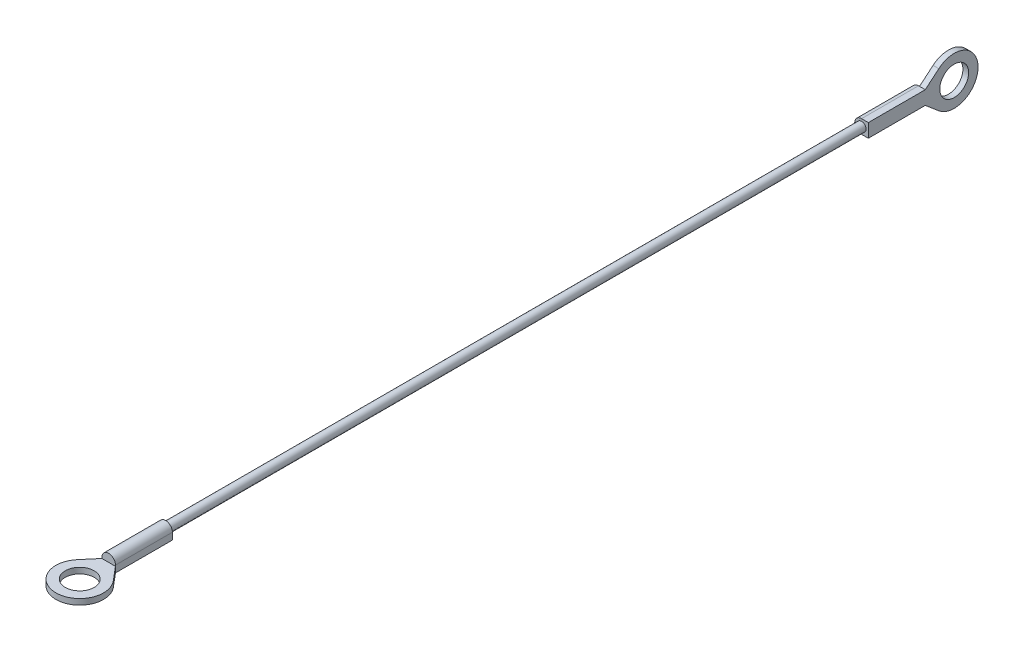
from build123d import *

# Parameters (mm, degrees)
SKETCH1_R           = 0.795
BOSS_EXTRUDE1_DEPTH = 61.12
BOSS_EXTRUDE2_DEPTH = 10
SKETCH3_R           = 2.54
BOSS_EXTRUDE3_DEPTH = 1.01
BOSS_EXTRUDE4_START = 10
BOSS_EXTRUDE4_DEPTH = 10
SKETCH5_R           = 2.54
BOSS_EXTRUDE5_DEPTH = 1.01


with BuildPart() as part:
    # Sketch1 → Boss-Extrude1 (new, symmetric)
    with BuildSketch(Plane.XY):
        with Locations(Location((0, 0, 0), (0, 0, 180))):
            Circle(SKETCH1_R)
    extrude(amount=BOSS_EXTRUDE1_DEPTH, both=True)

    # Sketch2 → Boss-Extrude2 (add)
    with BuildSketch(Plane.XY.offset(61.12)):
        with BuildLine():
            Line((-1.195, 0), (-1.195, -1.195))
            Line((-1.195, -1.195), (0, -1.195))
            Line((0, -1.195), (1.195, -1.195))
            Line((1.195, -1.195), (1.195, 0))
            ThreePointArc((1.195, 0), (0, 1.195), (-1.195, 0))
        make_face()
    extrude(amount=BOSS_EXTRUDE2_DEPTH)

    # Sketch3 → Boss-Extrude3 (add)
    with BuildSketch(Plane.XZ.offset(1.195)):
        with BuildLine():
            Line((1.195, 71.12), (3.201749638, 73.497242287))
            ThreePointArc((3.201749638, 73.497242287), (0, 80.39), (-3.201749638, 73.497242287))
            Line((-3.201749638, 73.497242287), (-1.195, 71.12))
            Line((-1.195, 71.12), (1.195, 71.12))
        make_face()
        with Locations(Location((0, 76.2, 0), (0, 0, 270))):
            Circle(SKETCH3_R, mode=Mode.SUBTRACT)
    extrude(amount=-BOSS_EXTRUDE3_DEPTH)

    # Sketch4 → Boss-Extrude4 (add)
    with BuildSketch(Plane(origin=(0, 0, -61.12), x_dir=(-1, 0, 0), z_dir=(0, 0, -1)).offset(BOSS_EXTRUDE4_START)):
        with BuildLine():
            Line((0, 1.195), (-1.195, 1.195))
            Line((-1.195, 1.195), (-1.195, 0))
            Line((-1.195, 0), (-1.195, -1.195))
            Line((-1.195, -1.195), (0, -1.195))
            ThreePointArc((0, -1.195), (1.195, 0), (0, 1.195))
        make_face()
    extrude(amount=-BOSS_EXTRUDE4_DEPTH)

    # Sketch5 → Boss-Extrude5 (add)
    with BuildSketch(Plane(origin=(1.195, 0, 0), x_dir=(0, 0, -1), z_dir=(1, 0, 0))):
        with BuildLine():
            Line((71.12, -1.195), (71.12, 1.195))
            Line((71.12, 1.195), (73.497242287, 3.201749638))
            ThreePointArc((73.497242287, 3.201749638), (80.39, 0), (73.497242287, -3.201749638))
            Line((73.497242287, -3.201749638), (71.12, -1.195))
        make_face()
        with Locations((76.2, 0)):
            Circle(SKETCH5_R, mode=Mode.SUBTRACT)
    extrude(amount=-BOSS_EXTRUDE5_DEPTH)


solid = part.part
